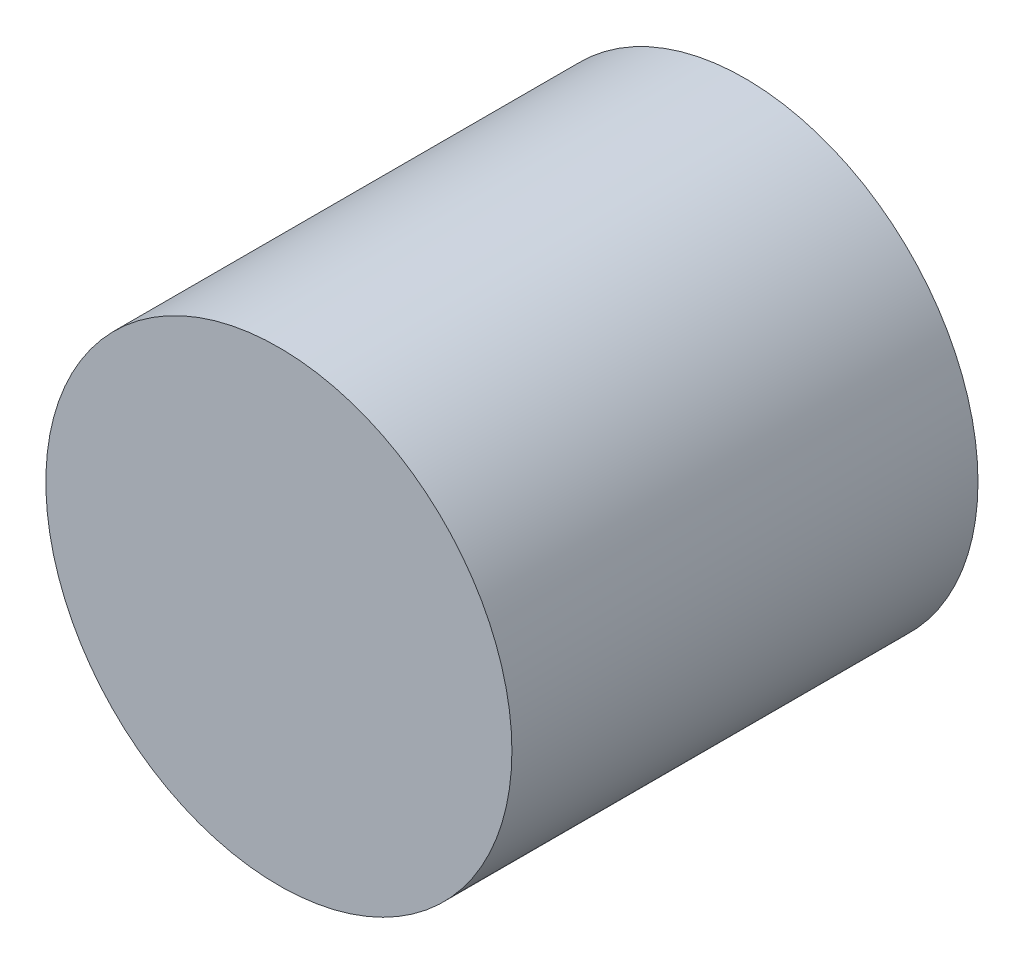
ISO-10303-21;
HEADER;
FILE_DESCRIPTION(('STEP AP214'),'2;1');
FILE_NAME('part.step','',(''),(''),'','','');
FILE_SCHEMA(('AUTOMOTIVE_DESIGN { 1 0 10303 214 1 1 1 1 }'));
ENDSEC;
DATA;
#1=APPLICATION_CONTEXT('core data for automotive mechanical design processes');
#2=APPLICATION_PROTOCOL_DEFINITION('international standard','automotive_design',2000,#1);
#3=PRODUCT_CONTEXT('',#1,'mechanical');
#4=PRODUCT('Part','Part','',(#3));
#5=PRODUCT_RELATED_PRODUCT_CATEGORY('part','',(#4));
#6=PRODUCT_DEFINITION_FORMATION('','',#4);
#7=PRODUCT_DEFINITION_CONTEXT('part definition',#1,'design');
#8=PRODUCT_DEFINITION('design','',#6,#7);
#9=PRODUCT_DEFINITION_SHAPE('','',#8);
#10=(LENGTH_UNIT() NAMED_UNIT(*) SI_UNIT(.MILLI.,.METRE.));
#11=(NAMED_UNIT(*) PLANE_ANGLE_UNIT() SI_UNIT($,.RADIAN.));
#12=(NAMED_UNIT(*) SI_UNIT($,.STERADIAN.) SOLID_ANGLE_UNIT());
#13=UNCERTAINTY_MEASURE_WITH_UNIT(LENGTH_MEASURE(1.E-05),#10,'distance_accuracy_value','');
#14=(GEOMETRIC_REPRESENTATION_CONTEXT(3) GLOBAL_UNCERTAINTY_ASSIGNED_CONTEXT((#13)) GLOBAL_UNIT_ASSIGNED_CONTEXT((#10,
#11,#12)) REPRESENTATION_CONTEXT('',''));
#15=CARTESIAN_POINT('',(0.,0.,0.));
#16=DIRECTION('',(0.,0.,1.));
#17=DIRECTION('',(1.,0.,0.));
#18=AXIS2_PLACEMENT_3D('',#15,#16,#17);
#19=CARTESIAN_POINT('',(0.,0.,32.));
#20=DIRECTION('',(0.,0.,1.));
#21=DIRECTION('',(1.,0.,0.));
#22=AXIS2_PLACEMENT_3D('',#19,#20,#21);
#23=CYLINDRICAL_SURFACE('',#22,6.);
#24=CARTESIAN_POINT('',(0.,0.,12.));
#25=DIRECTION('',(0.,0.,1.));
#26=DIRECTION('',(1.,0.,0.));
#27=AXIS2_PLACEMENT_3D('',#24,#25,#26);
#28=CIRCLE('',#27,6.);
#29=CARTESIAN_POINT('',(6.,0.,12.));
#30=VERTEX_POINT('',#29);
#31=EDGE_CURVE('E26',#30,#30,#28,.T.);
#32=ORIENTED_EDGE('',*,*,#31,.F.);
#33=EDGE_LOOP('',(#32));
#34=FACE_BOUND('',#33,.T.);
#35=CARTESIAN_POINT('',(0.,0.,0.));
#36=DIRECTION('',(0.,0.,1.));
#37=DIRECTION('',(1.,0.,0.));
#38=AXIS2_PLACEMENT_3D('',#35,#36,#37);
#39=CIRCLE('',#38,6.);
#40=CARTESIAN_POINT('',(6.,0.,0.));
#41=VERTEX_POINT('',#40);
#42=EDGE_CURVE('E8',#41,#41,#39,.T.);
#43=ORIENTED_EDGE('',*,*,#42,.T.);
#44=EDGE_LOOP('',(#43));
#45=FACE_BOUND('',#44,.T.);
#46=ADVANCED_FACE('F12',(#34,#45),#23,.T.);
#47=CARTESIAN_POINT('',(2.5,0.,0.));
#48=DIRECTION('',(0.,0.,1.));
#49=DIRECTION('',(1.,0.,0.));
#50=AXIS2_PLACEMENT_3D('',#47,#48,#49);
#51=PLANE('',#50);
#52=ORIENTED_EDGE('',*,*,#42,.F.);
#53=EDGE_LOOP('',(#52));
#54=FACE_BOUND('',#53,.T.);
#55=CARTESIAN_POINT('',(0.,0.,0.));
#56=DIRECTION('',(0.,0.,1.));
#57=DIRECTION('',(1.,0.,0.));
#58=AXIS2_PLACEMENT_3D('',#55,#56,#57);
#59=CIRCLE('',#58,2.5);
#60=CARTESIAN_POINT('',(2.5,0.,0.));
#61=VERTEX_POINT('',#60);
#62=EDGE_CURVE('E18',#61,#61,#59,.T.);
#63=ORIENTED_EDGE('',*,*,#62,.T.);
#64=EDGE_LOOP('',(#63));
#65=FACE_BOUND('',#64,.T.);
#66=ADVANCED_FACE('F35',(#54,#65),#51,.F.);
#67=CARTESIAN_POINT('',(0.,0.,32.));
#68=DIRECTION('',(0.,0.,1.));
#69=DIRECTION('',(1.,0.,0.));
#70=AXIS2_PLACEMENT_3D('',#67,#68,#69);
#71=CYLINDRICAL_SURFACE('',#70,2.5);
#72=ORIENTED_EDGE('',*,*,#62,.F.);
#73=EDGE_LOOP('',(#72));
#74=FACE_BOUND('',#73,.T.);
#75=CARTESIAN_POINT('',(0.,0.,6.4));
#76=DIRECTION('',(0.,0.,1.));
#77=DIRECTION('',(1.,0.,0.));
#78=AXIS2_PLACEMENT_3D('',#75,#76,#77);
#79=CIRCLE('',#78,2.5);
#80=CARTESIAN_POINT('',(2.5,0.,6.4));
#81=VERTEX_POINT('',#80);
#82=EDGE_CURVE('E22',#81,#81,#79,.T.);
#83=ORIENTED_EDGE('',*,*,#82,.T.);
#84=EDGE_LOOP('',(#83));
#85=FACE_BOUND('',#84,.T.);
#86=ADVANCED_FACE('F41',(#74,#85),#71,.F.);
#87=CARTESIAN_POINT('',(0.,0.,6.4));
#88=DIRECTION('',(0.,0.,1.));
#89=DIRECTION('',(1.,0.,0.));
#90=AXIS2_PLACEMENT_3D('',#87,#88,#89);
#91=PLANE('',#90);
#92=ORIENTED_EDGE('',*,*,#82,.F.);
#93=EDGE_LOOP('',(#92));
#94=FACE_BOUND('',#93,.T.);
#95=ADVANCED_FACE('F47',(#94),#91,.F.);
#96=CARTESIAN_POINT('',(6.,0.,12.));
#97=DIRECTION('',(0.,0.,-1.));
#98=DIRECTION('',(-1.,0.,0.));
#99=AXIS2_PLACEMENT_3D('',#96,#97,#98);
#100=PLANE('',#99);
#101=ORIENTED_EDGE('',*,*,#31,.T.);
#102=EDGE_LOOP('',(#101));
#103=FACE_BOUND('',#102,.T.);
#104=ADVANCED_FACE('F32',(#103),#100,.F.);
#105=CLOSED_SHELL('',(#46,#66,#86,#95,#104));
#106=MANIFOLD_SOLID_BREP('B1',#105);
#107=ADVANCED_BREP_SHAPE_REPRESENTATION('',(#18,#106),#14);
#108=SHAPE_DEFINITION_REPRESENTATION(#9,#107);
ENDSEC;
END-ISO-10303-21;
